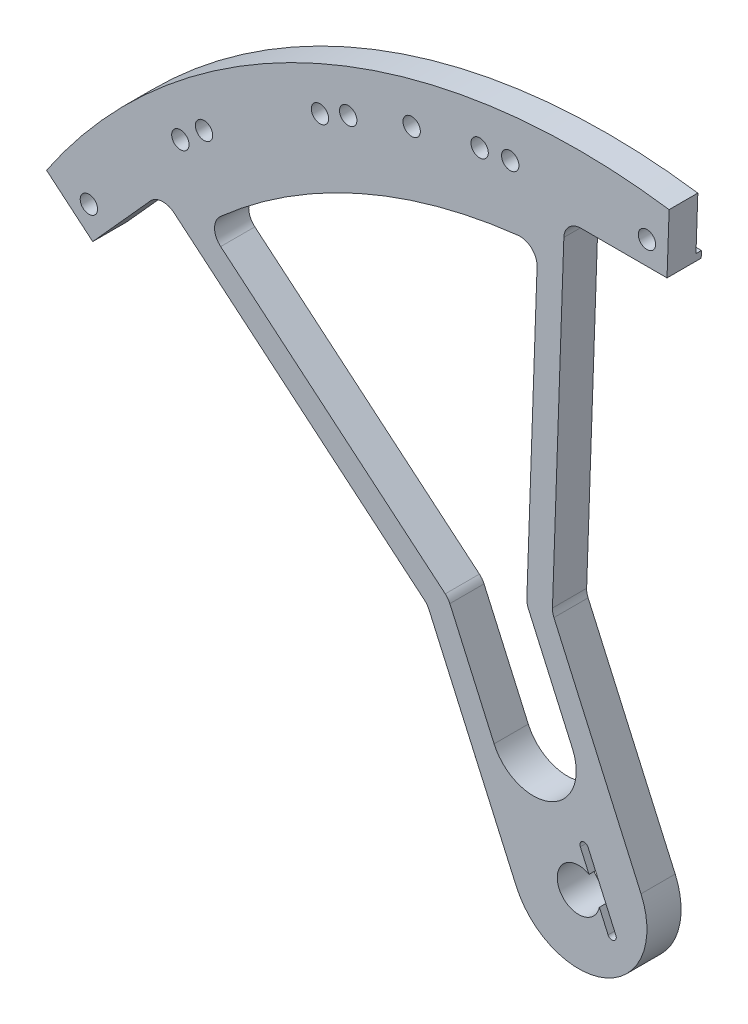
from build123d import *

# Parameters (mm, degrees)
SKETCH2_R                    = 1.9812
BOSS_EXTRUDE1_DEPTH          = 3.175
CUT_EXTRUDE1_START           = -0.508
CUT_EXTRUDE1_DEPTH           = 0.508
F_52_0_0635_DIAMETER_HOLE1_D = 1.6129
CUT_EXTRUDE2_DEPTH           = 89.235891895
CUT_EXTRUDE3_DEPTH           = 0.79248


with BuildPart() as part:
    # Sketch2 → Boss-Extrude1 (new body)
    with BuildSketch(Plane.XY):
        with BuildLine():
            Line((-4.081701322, -71.539382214), (-49.425108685, -33.491745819))
            ThreePointArc((-49.425108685, -33.491745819), (-24.213540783, -12.290496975), (8.411889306, -7.741055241))
            Line((8.411889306, -7.741055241), (6.346131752, -66.896611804))
            ThreePointArc((6.346131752, -66.896611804), (2.582777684, -72.476013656), (-4.081701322, -71.539382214))
        make_face()
        with Locations((0, -66.675)):
            Circle(SKETCH2_R, mode=Mode.SUBTRACT)
    extrude(amount=-BOSS_EXTRUDE1_DEPTH)

    # Sketch4 → Cut-Extrude1 (cut)
    with BuildSketch(Plane(origin=(0, 0, -3.175), x_dir=(-1, 0, 0), z_dir=(0, 0, -1)).offset(CUT_EXTRUDE1_START)):
        with BuildLine():
            Line((45.624021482, -36.681236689), (35.035420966, -24.921405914))
            Line((35.035420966, -24.921405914), (22.169357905, -16.881798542))
            Line((22.169357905, -16.881798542), (7.585689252, -12.7))
            Line((7.585689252, -12.7), (-8.23871914, -12.7))
            Line((-8.23871914, -12.7), (-8.411889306, -7.741055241))
            ThreePointArc((-8.411889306, -7.741055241), (24.213540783, -12.290496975), (49.425108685, -33.491745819))
            Line((49.425108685, -33.491745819), (45.624021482, -36.681236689))
        make_face()
    extrude(amount=CUT_EXTRUDE1_DEPTH, mode=Mode.SUBTRACT)

    # 52 _0.0635_ Diameter Hole1 (through all)
    with Locations(Plane(origin=(0, 0, -2.667), x_dir=(-1, 0, 0), z_dir=(0, 0, -1))):
        with Locations((9.193577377, -11.575638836), (-6.35000813, -11.176), (6.34999187, -11.176), (21.401601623, -15.076230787), (24.024875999, -16.244188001), (34.795088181, -22.974160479), (36.994808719, -24.819945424), (45.492769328, -34.25788299), (15.505441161, -13.008069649)):
            Hole(F_52_0_0635_DIAMETER_HOLE1_D / 2)

    # Sketch14 → Cut-Extrude2 (cut, through all)
    with BuildSketch(Plane(origin=(0, 0, -3.175), x_dir=(-1, 0, 0), z_dir=(0, 0, -1))):
        with BuildLine():
            Line((-8.216544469, -13.334999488), (-6.346131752, -66.896611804))
            ThreePointArc((-6.346131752, -66.896611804), (-6.233332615, -65.463362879), (-5.801013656, -64.092222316))
            Line((-5.801013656, -64.092222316), (2.291275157, -45.916644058))
            ThreePointArc((2.291275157, -45.916644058), (2.399354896, -45.573858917), (2.427554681, -45.215546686))
            Line((2.427554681, -45.215546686), (1.367763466, -14.867097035))
            ThreePointArc((1.367763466, -14.867097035), (0.884000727, -13.780548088), (-0.218769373, -13.334999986))
            Line((-0.218769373, -13.334999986), (-8.216544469, -13.334999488))
        make_face()
        with BuildLine():
            Line((14.323130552, -50.511798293), (37.58556261, -30.992300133))
            ThreePointArc((37.58556261, -30.992300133), (38.716726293, -30.624762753), (39.785730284, -31.146150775))
            Line((39.785730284, -31.146150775), (45.137286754, -37.08965562))
            Line((45.137286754, -37.08965562), (4.081701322, -71.539382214))
            ThreePointArc((4.081701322, -71.539382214), (5.071335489, -70.496525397), (5.801013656, -69.257777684))
            Line((5.801013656, -69.257777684), (13.893302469, -51.082199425))
            ThreePointArc((13.893302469, -51.082199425), (14.075722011, -50.772512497), (14.323130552, -50.511798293))
        make_face()
        with BuildLine():
            Line((33.250863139, -31.545911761), (12.386970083, -49.052796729))
            ThreePointArc((12.386970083, -49.052796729), (12.139561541, -49.313510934), (11.957142, -49.623197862))
            Line((11.957142, -49.623197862), (7.847798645, -58.852934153))
            ThreePointArc((7.847798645, -58.852934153), (2.582777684, -60.873986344), (0.561725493, -55.608965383))
            Line((0.561725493, -55.608965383), (4.671068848, -46.379229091))
            ThreePointArc((4.671068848, -46.379229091), (4.779148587, -46.036443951), (4.807348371, -45.678131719))
            Line((4.807348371, -45.678131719), (3.856829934, -18.458845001))
            ThreePointArc((3.856829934, -18.458845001), (4.365093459, -17.238327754), (5.621250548, -16.825940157))
            ThreePointArc((5.621250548, -16.825940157), (20.4039437, -20.846992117), (33.28372009, -29.142065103))
            ThreePointArc((33.28372009, -29.142065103), (33.817789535, -30.351512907), (33.250863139, -31.545911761))
        make_face()
    extrude(amount=-CUT_EXTRUDE2_DEPTH, mode=Mode.SUBTRACT)

    # Sketch15 → Cut-Extrude3 (cut)
    with BuildSketch(Plane.XY):
        with BuildLine():
            Line((0.883991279, -62.805951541), (3.466768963, -68.606965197))
            ThreePointArc((3.466768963, -68.606965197), (3.265951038, -69.130113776), (2.742802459, -68.929295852))
            Line((2.742802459, -68.929295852), (0.160024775, -63.128282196))
            ThreePointArc((0.160024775, -63.128282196), (0.3608427, -62.605133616), (0.883991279, -62.805951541))
        make_face()
    extrude(amount=-CUT_EXTRUDE3_DEPTH, mode=Mode.SUBTRACT)


solid = part.part
